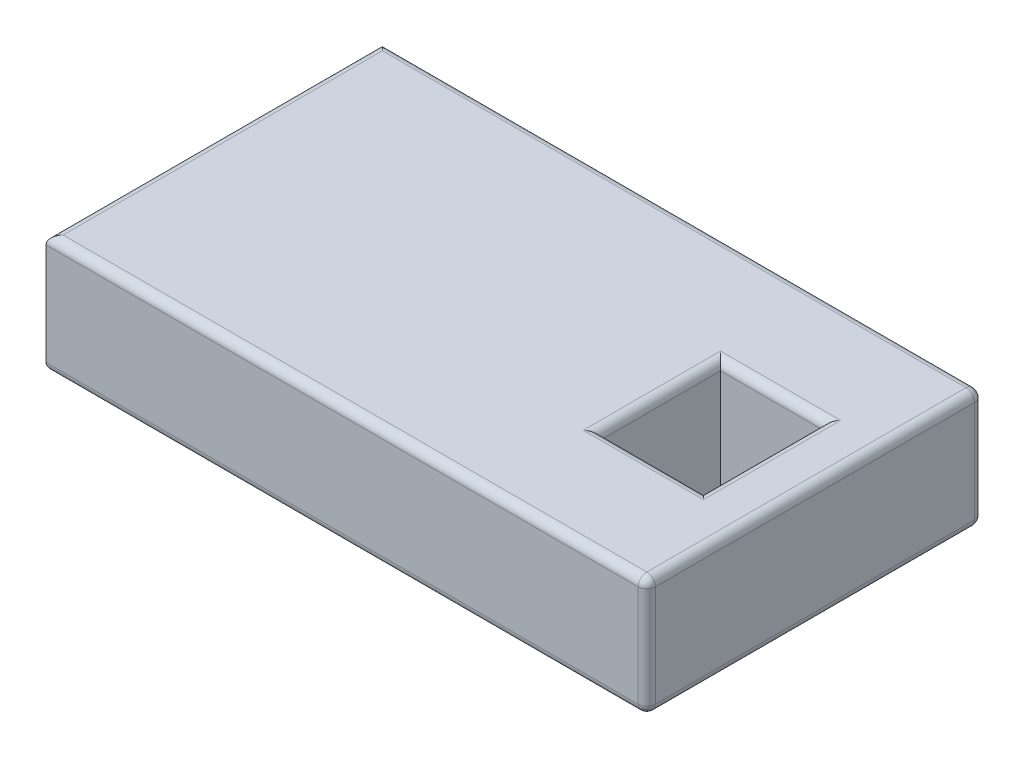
from build123d import *

# Parameters (mm, degrees)
SKETCH1_W           = 19.59
SKETCH1_H           = 6.92
BOSS_EXTRUDE1_DEPTH = 35
SKETCH2_W           = 6
SKETCH2_H           = 7
CUT_EXTRUDE1_DEPTH  = 37.997681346
SKETCH3_R           = 2.16
CUT_EXTRUDE2_DEPTH  = 2
FILLET1_R           = 0.5


with BuildPart() as part:
    # Sketch1 → Boss-Extrude1 (new body)
    with BuildSketch(Plane(origin=(0, 0, 0), x_dir=(0, 0, -1), z_dir=(1, 0, 0))):
        Rectangle(SKETCH1_W, SKETCH1_H)
    extrude(amount=BOSS_EXTRUDE1_DEPTH)

    # Sketch2 → Cut-Extrude1 (cut, through all)
    with BuildSketch(Plane(origin=(0, 3.46, 0), x_dir=(1, 0, 0), z_dir=(0, 1, 0))):
        with Locations((29, 0)):
            Rectangle(SKETCH2_W, SKETCH2_H)
    extrude(amount=-CUT_EXTRUDE1_DEPTH, mode=Mode.SUBTRACT)

    # Sketch3 → Cut-Extrude2 (cut)
    with BuildSketch(Plane.ZY):
        with Locations((-5.858, 0)):
            Circle(SKETCH3_R)
        with Locations((5.858, 0)):
            Circle(SKETCH3_R)
    extrude(amount=-CUT_EXTRUDE2_DEPTH, mode=Mode.SUBTRACT)

    # Fillet1
    fillet1_edges = [part.edges().sort_by_distance(p)[0] for p in [
        (35, 0, 9.795),
        (35, -3.46, 0),
        (26, -3.46, 0),
        (29, -3.46, -3.5),
        (32, -3.46, 0),
        (29, -3.46, 3.5),
        (26, 3.46, 0),
        (29, 3.46, 3.5),
        (32, 3.46, 0),
        (29, 3.46, -3.5),
        (35, 0, -9.795),
        (0, -3.46, 0),
        (0, 3.46, 0),
        (35, 3.46, 0),
        (17.5, -3.46, -9.795),
        (17.5, -3.46, 9.795),
        (17.5, 3.46, 9.795),
        (17.5, 3.46, -9.795),
    ]]
    fillet(fillet1_edges, radius=FILLET1_R)


solid = part.part
